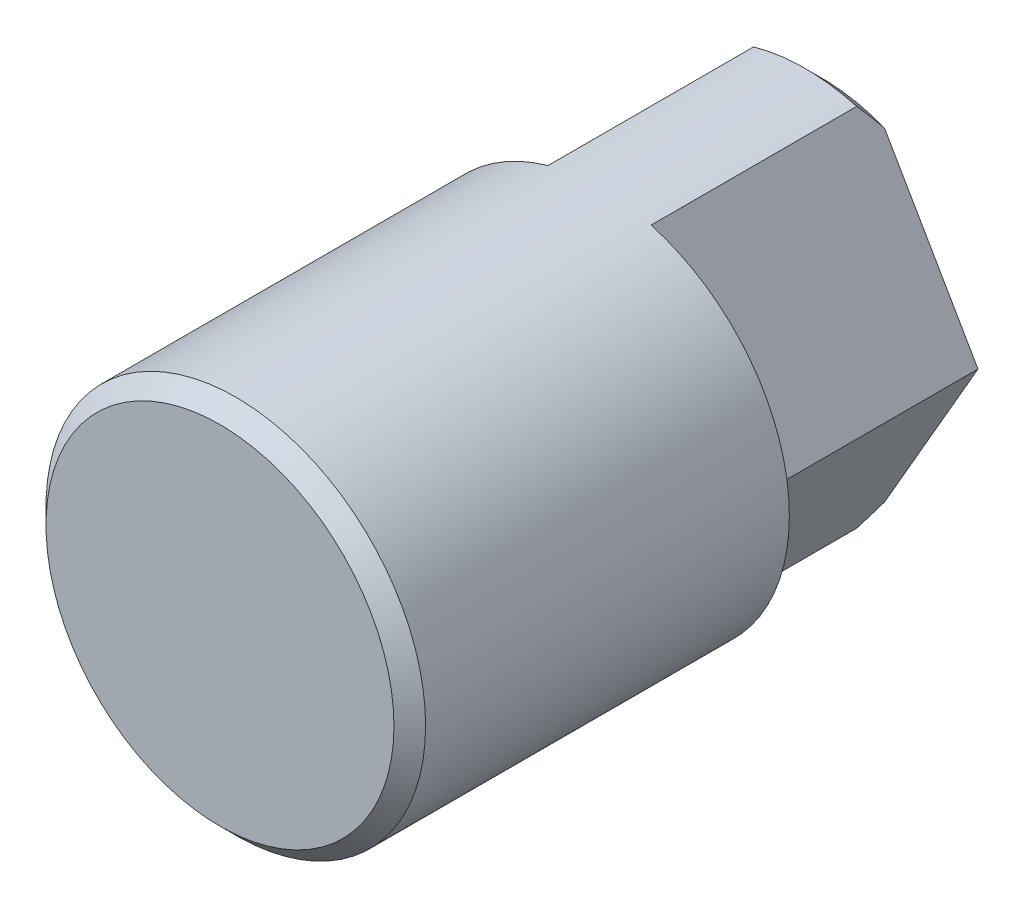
ISO-10303-21;
HEADER;
FILE_DESCRIPTION(('STEP AP214'),'2;1');
FILE_NAME('part.step','',(''),(''),'','','');
FILE_SCHEMA(('AUTOMOTIVE_DESIGN { 1 0 10303 214 1 1 1 1 }'));
ENDSEC;
DATA;
#1=APPLICATION_CONTEXT('core data for automotive mechanical design processes');
#2=APPLICATION_PROTOCOL_DEFINITION('international standard','automotive_design',2000,#1);
#3=PRODUCT_CONTEXT('',#1,'mechanical');
#4=PRODUCT('Part','Part','',(#3));
#5=PRODUCT_RELATED_PRODUCT_CATEGORY('part','',(#4));
#6=PRODUCT_DEFINITION_FORMATION('','',#4);
#7=PRODUCT_DEFINITION_CONTEXT('part definition',#1,'design');
#8=PRODUCT_DEFINITION('design','',#6,#7);
#9=PRODUCT_DEFINITION_SHAPE('','',#8);
#10=(LENGTH_UNIT() NAMED_UNIT(*) SI_UNIT(.MILLI.,.METRE.));
#11=(NAMED_UNIT(*) PLANE_ANGLE_UNIT() SI_UNIT($,.RADIAN.));
#12=(NAMED_UNIT(*) SI_UNIT($,.STERADIAN.) SOLID_ANGLE_UNIT());
#13=UNCERTAINTY_MEASURE_WITH_UNIT(LENGTH_MEASURE(1.E-05),#10,'distance_accuracy_value','');
#14=(GEOMETRIC_REPRESENTATION_CONTEXT(3) GLOBAL_UNCERTAINTY_ASSIGNED_CONTEXT((#13)) GLOBAL_UNIT_ASSIGNED_CONTEXT((#10,
#11,#12)) REPRESENTATION_CONTEXT('',''));
#15=CARTESIAN_POINT('',(0.,0.,0.));
#16=DIRECTION('',(0.,0.,1.));
#17=DIRECTION('',(1.,0.,0.));
#18=AXIS2_PLACEMENT_3D('',#15,#16,#17);
#19=CARTESIAN_POINT('',(0.,0.,0.));
#20=DIRECTION('',(0.,0.,1.));
#21=DIRECTION('',(1.,0.,0.));
#22=AXIS2_PLACEMENT_3D('',#19,#20,#21);
#23=CYLINDRICAL_SURFACE('',#22,6.);
#24=CARTESIAN_POINT('',(0.,0.,18.5));
#25=DIRECTION('',(0.,0.,1.));
#26=DIRECTION('',(1.,0.,0.));
#27=AXIS2_PLACEMENT_3D('',#24,#25,#26);
#28=CIRCLE('',#27,6.);
#29=CARTESIAN_POINT('',(6.,0.,18.5));
#30=VERTEX_POINT('',#29);
#31=EDGE_CURVE('E9',#30,#30,#28,.F.);
#32=ORIENTED_EDGE('',*,*,#31,.T.);
#33=EDGE_LOOP('',(#32));
#34=FACE_BOUND('',#33,.T.);
#35=CARTESIAN_POINT('',(0.,0.,7.));
#36=DIRECTION('',(0.,0.,-1.));
#37=DIRECTION('',(-1.,0.,0.));
#38=AXIS2_PLACEMENT_3D('',#35,#36,#37);
#39=CIRCLE('',#38,6.);
#40=CARTESIAN_POINT('',(1.63,5.77434844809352,7.));
#41=VERTEX_POINT('',#40);
#42=CARTESIAN_POINT('',(1.63,-5.77434844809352,7.));
#43=VERTEX_POINT('',#42);
#44=EDGE_CURVE('E175',#41,#43,#39,.T.);
#45=ORIENTED_EDGE('',*,*,#44,.F.);
#46=DIRECTION('',(0.,0.,-1.));
#47=VECTOR('',#46,1.);
#48=CARTESIAN_POINT('',(1.63,5.77434844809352,7.));
#49=LINE('',#48,#47);
#50=CARTESIAN_POINT('',(1.63,5.77434844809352,0.5));
#51=VERTEX_POINT('',#50);
#52=EDGE_CURVE('E86',#41,#51,#49,.T.);
#53=ORIENTED_EDGE('',*,*,#52,.T.);
#54=CARTESIAN_POINT('',(0.,0.,0.5));
#55=DIRECTION('',(0.,0.,-1.));
#56=DIRECTION('',(-1.,0.,0.));
#57=AXIS2_PLACEMENT_3D('',#54,#55,#56);
#58=CIRCLE('',#57,6.);
#59=CARTESIAN_POINT('',(-1.63,5.77434844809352,0.5));
#60=VERTEX_POINT('',#59);
#61=EDGE_CURVE('E120',#51,#60,#58,.F.);
#62=ORIENTED_EDGE('',*,*,#61,.T.);
#63=DIRECTION('',(0.,0.,-1.));
#64=VECTOR('',#63,1.);
#65=CARTESIAN_POINT('',(-1.63,5.77434844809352,7.));
#66=LINE('',#65,#64);
#67=CARTESIAN_POINT('',(-1.63,5.77434844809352,7.));
#68=VERTEX_POINT('',#67);
#69=EDGE_CURVE('E36',#68,#60,#66,.T.);
#70=ORIENTED_EDGE('',*,*,#69,.F.);
#71=CARTESIAN_POINT('',(-1.63,-5.77434844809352,7.));
#72=VERTEX_POINT('',#71);
#73=EDGE_CURVE('E170',#72,#68,#39,.T.);
#74=ORIENTED_EDGE('',*,*,#73,.F.);
#75=DIRECTION('',(0.,0.,-1.));
#76=VECTOR('',#75,1.);
#77=CARTESIAN_POINT('',(-1.63,-5.77434844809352,7.));
#78=LINE('',#77,#76);
#79=CARTESIAN_POINT('',(-1.63,-5.77434844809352,0.5));
#80=VERTEX_POINT('',#79);
#81=EDGE_CURVE('E117',#72,#80,#78,.T.);
#82=ORIENTED_EDGE('',*,*,#81,.T.);
#83=CARTESIAN_POINT('',(1.63,-5.77434844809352,0.5));
#84=VERTEX_POINT('',#83);
#85=EDGE_CURVE('E126',#80,#84,#58,.F.);
#86=ORIENTED_EDGE('',*,*,#85,.T.);
#87=DIRECTION('',(0.,0.,-1.));
#88=VECTOR('',#87,1.);
#89=CARTESIAN_POINT('',(1.63,-5.77434844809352,7.));
#90=LINE('',#89,#88);
#91=EDGE_CURVE('E85',#43,#84,#90,.T.);
#92=ORIENTED_EDGE('',*,*,#91,.F.);
#93=EDGE_LOOP('',(#45,#53,#62,#70,#74,#82,#86,#92));
#94=FACE_BOUND('',#93,.T.);
#95=ADVANCED_FACE('F14',(#34,#94),#23,.T.);
#96=CARTESIAN_POINT('',(0.,0.,0.));
#97=DIRECTION('',(0.,0.,-1.));
#98=DIRECTION('',(-1.,0.,0.));
#99=AXIS2_PLACEMENT_3D('',#96,#97,#98);
#100=PLANE('',#99);
#101=DIRECTION('',(0.5,-0.866025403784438,0.));
#102=VECTOR('',#101,1.);
#103=CARTESIAN_POINT('',(1.63,5.77434844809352,0.));
#104=LINE('',#103,#102);
#105=CARTESIAN_POINT('',(2.00746859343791,5.1205536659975,0.));
#106=VERTEX_POINT('',#105);
#107=CARTESIAN_POINT('',(4.9638216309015,0.,0.));
#108=VERTEX_POINT('',#107);
#109=EDGE_CURVE('E28',#106,#108,#104,.T.);
#110=ORIENTED_EDGE('',*,*,#109,.T.);
#111=DIRECTION('',(-0.5,-0.866025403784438,0.));
#112=VECTOR('',#111,1.);
#113=CARTESIAN_POINT('',(1.63,-5.77434844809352,0.));
#114=LINE('',#113,#112);
#115=CARTESIAN_POINT('',(2.00746859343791,-5.1205536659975,0.));
#116=VERTEX_POINT('',#115);
#117=EDGE_CURVE('E89',#108,#116,#114,.T.);
#118=ORIENTED_EDGE('',*,*,#117,.T.);
#119=CARTESIAN_POINT('',(0.,0.,0.));
#120=DIRECTION('',(0.,0.,-1.));
#121=DIRECTION('',(-1.,0.,0.));
#122=AXIS2_PLACEMENT_3D('',#119,#120,#121);
#123=CIRCLE('',#122,5.5);
#124=CARTESIAN_POINT('',(-2.00746859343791,-5.1205536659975,0.));
#125=VERTEX_POINT('',#124);
#126=EDGE_CURVE('E129',#116,#125,#123,.T.);
#127=ORIENTED_EDGE('',*,*,#126,.T.);
#128=DIRECTION('',(-0.5,0.866025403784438,0.));
#129=VECTOR('',#128,1.);
#130=CARTESIAN_POINT('',(-1.63,-5.77434844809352,0.));
#131=LINE('',#130,#129);
#132=CARTESIAN_POINT('',(-4.9638216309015,0.,0.));
#133=VERTEX_POINT('',#132);
#134=EDGE_CURVE('E105',#125,#133,#131,.T.);
#135=ORIENTED_EDGE('',*,*,#134,.T.);
#136=DIRECTION('',(0.5,0.866025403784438,0.));
#137=VECTOR('',#136,1.);
#138=CARTESIAN_POINT('',(-1.63,5.77434844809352,0.));
#139=LINE('',#138,#137);
#140=CARTESIAN_POINT('',(-2.00746859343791,5.1205536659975,0.));
#141=VERTEX_POINT('',#140);
#142=EDGE_CURVE('E103',#133,#141,#139,.T.);
#143=ORIENTED_EDGE('',*,*,#142,.T.);
#144=EDGE_CURVE('E102',#141,#106,#123,.T.);
#145=ORIENTED_EDGE('',*,*,#144,.T.);
#146=EDGE_LOOP('',(#110,#118,#127,#135,#143,#145));
#147=FACE_BOUND('',#146,.T.);
#148=ADVANCED_FACE('F99',(#147),#100,.T.);
#149=CARTESIAN_POINT('',(0.,0.,0.));
#150=DIRECTION('',(0.,0.,1.));
#151=DIRECTION('',(1.,0.,0.));
#152=AXIS2_PLACEMENT_3D('',#149,#150,#151);
#153=CONICAL_SURFACE('',#152,5.5,0.785398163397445);
#154=ORIENTED_EDGE('',*,*,#85,.F.);
#155=CARTESIAN_POINT('',(-1.62988452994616,-5.77454844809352,0.500161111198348));
#156=CARTESIAN_POINT('',(-1.66085599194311,-5.72090430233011,0.456948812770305));
#157=CARTESIAN_POINT('',(-1.69194256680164,-5.66706077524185,0.414064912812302));
#158=CARTESIAN_POINT('',(-1.7543589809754,-5.55895237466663,0.329033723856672));
#159=CARTESIAN_POINT('',(-1.7856887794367,-5.50468757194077,0.286886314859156));
#160=CARTESIAN_POINT('',(-1.84861554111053,-5.39569522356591,0.203392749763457));
#161=CARTESIAN_POINT('',(-1.88021251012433,-5.34096766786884,0.162046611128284));
#162=CARTESIAN_POINT('',(-1.94369815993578,-5.23100729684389,0.0802372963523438));
#163=CARTESIAN_POINT('',(-1.97558688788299,-5.17577439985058,0.0397742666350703));
#164=CARTESIAN_POINT('',(-2.00762891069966,-5.12027598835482,-0.000199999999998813));
#165=B_SPLINE_CURVE_WITH_KNOTS('',3,(#155,#156,#157,#158,#159,#160,#161,#162,#163,#164),
.UNSPECIFIED.,.F.,.F.,(4,2,2,2,4),(0.,0.226579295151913,0.453121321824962,0.679668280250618,
0.906252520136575),.UNSPECIFIED.);
#166=EDGE_CURVE('E163',#80,#125,#165,.T.);
#167=ORIENTED_EDGE('',*,*,#166,.T.);
#168=ORIENTED_EDGE('',*,*,#126,.F.);
#169=CARTESIAN_POINT('',(2.00762891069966,-5.12027598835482,-0.000199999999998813));
#170=CARTESIAN_POINT('',(1.97558688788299,-5.17577439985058,0.0397742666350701));
#171=CARTESIAN_POINT('',(1.94369815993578,-5.23100729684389,0.0802372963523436));
#172=CARTESIAN_POINT('',(1.88021251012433,-5.34096766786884,0.162046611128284));
#173=CARTESIAN_POINT('',(1.84861554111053,-5.39569522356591,0.203392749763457));
#174=CARTESIAN_POINT('',(1.7856887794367,-5.50468757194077,0.286886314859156));
#175=CARTESIAN_POINT('',(1.7543589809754,-5.55895237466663,0.329033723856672));
#176=CARTESIAN_POINT('',(1.69194256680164,-5.66706077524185,0.414064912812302));
#177=CARTESIAN_POINT('',(1.66085599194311,-5.72090430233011,0.456948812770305));
#178=CARTESIAN_POINT('',(1.62988452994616,-5.77454844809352,0.500161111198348));
#179=B_SPLINE_CURVE_WITH_KNOTS('',3,(#169,#170,#171,#172,#173,#174,#175,#176,#177,#178),
.UNSPECIFIED.,.F.,.F.,(4,2,2,2,4),(0.,0.226584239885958,0.453131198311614,0.679673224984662,
0.906252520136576),.UNSPECIFIED.);
#180=EDGE_CURVE('E92',#116,#84,#179,.T.);
#181=ORIENTED_EDGE('',*,*,#180,.T.);
#182=EDGE_LOOP('',(#154,#167,#168,#181));
#183=FACE_BOUND('',#182,.T.);
#184=ADVANCED_FACE('F146',(#183),#153,.T.);
#185=ORIENTED_EDGE('',*,*,#61,.F.);
#186=CARTESIAN_POINT('',(1.62988452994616,5.77454844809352,0.500161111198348));
#187=CARTESIAN_POINT('',(1.66085599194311,5.72090430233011,0.456948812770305));
#188=CARTESIAN_POINT('',(1.69194256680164,5.66706077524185,0.414064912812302));
#189=CARTESIAN_POINT('',(1.7543589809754,5.55895237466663,0.329033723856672));
#190=CARTESIAN_POINT('',(1.7856887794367,5.50468757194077,0.286886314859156));
#191=CARTESIAN_POINT('',(1.84861554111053,5.39569522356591,0.203392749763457));
#192=CARTESIAN_POINT('',(1.88021251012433,5.34096766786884,0.162046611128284));
#193=CARTESIAN_POINT('',(1.94369815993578,5.23100729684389,0.0802372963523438));
#194=CARTESIAN_POINT('',(1.97558688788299,5.17577439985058,0.0397742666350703));
#195=CARTESIAN_POINT('',(2.00762891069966,5.12027598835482,-0.000199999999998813));
#196=B_SPLINE_CURVE_WITH_KNOTS('',3,(#186,#187,#188,#189,#190,#191,#192,#193,#194,#195),
.UNSPECIFIED.,.F.,.F.,(4,2,2,2,4),(0.,0.226579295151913,0.453121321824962,0.679668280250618,
0.906252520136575),.UNSPECIFIED.);
#197=EDGE_CURVE('E139',#51,#106,#196,.T.);
#198=ORIENTED_EDGE('',*,*,#197,.T.);
#199=ORIENTED_EDGE('',*,*,#144,.F.);
#200=CARTESIAN_POINT('',(-2.00762891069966,5.12027598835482,-0.000199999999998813));
#201=CARTESIAN_POINT('',(-1.97558688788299,5.17577439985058,0.0397742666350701));
#202=CARTESIAN_POINT('',(-1.94369815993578,5.23100729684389,0.0802372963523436));
#203=CARTESIAN_POINT('',(-1.88021251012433,5.34096766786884,0.162046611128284));
#204=CARTESIAN_POINT('',(-1.84861554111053,5.39569522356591,0.203392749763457));
#205=CARTESIAN_POINT('',(-1.7856887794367,5.50468757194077,0.286886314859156));
#206=CARTESIAN_POINT('',(-1.7543589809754,5.55895237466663,0.329033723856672));
#207=CARTESIAN_POINT('',(-1.69194256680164,5.66706077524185,0.414064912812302));
#208=CARTESIAN_POINT('',(-1.66085599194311,5.72090430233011,0.456948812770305));
#209=CARTESIAN_POINT('',(-1.62988452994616,5.77454844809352,0.500161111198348));
#210=B_SPLINE_CURVE_WITH_KNOTS('',3,(#200,#201,#202,#203,#204,#205,#206,#207,#208,#209),
.UNSPECIFIED.,.F.,.F.,(4,2,2,2,4),(0.,0.226584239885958,0.453131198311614,0.679673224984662,
0.906252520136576),.UNSPECIFIED.);
#211=EDGE_CURVE('E131',#141,#60,#210,.T.);
#212=ORIENTED_EDGE('',*,*,#211,.T.);
#213=EDGE_LOOP('',(#185,#198,#199,#212));
#214=FACE_BOUND('',#213,.T.);
#215=ADVANCED_FACE('F154',(#214),#153,.T.);
#216=CARTESIAN_POINT('',(-1.63,5.77434844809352,7.));
#217=DIRECTION('',(-0.866025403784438,0.5,0.));
#218=DIRECTION('',(0.5,0.866025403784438,0.));
#219=AXIS2_PLACEMENT_3D('',#216,#217,#218);
#220=PLANE('',#219);
#221=ORIENTED_EDGE('',*,*,#142,.F.);
#222=DIRECTION('',(0.,0.,-1.));
#223=VECTOR('',#222,1.);
#224=CARTESIAN_POINT('',(-4.9638216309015,0.,7.));
#225=LINE('',#224,#223);
#226=CARTESIAN_POINT('',(-4.9638216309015,0.,7.));
#227=VERTEX_POINT('',#226);
#228=EDGE_CURVE('E116',#227,#133,#225,.T.);
#229=ORIENTED_EDGE('',*,*,#228,.F.);
#230=DIRECTION('',(0.5,0.866025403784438,0.));
#231=VECTOR('',#230,1.);
#232=CARTESIAN_POINT('',(-1.63,5.77434844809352,7.));
#233=LINE('',#232,#231);
#234=EDGE_CURVE('E111',#227,#68,#233,.T.);
#235=ORIENTED_EDGE('',*,*,#234,.T.);
#236=ORIENTED_EDGE('',*,*,#69,.T.);
#237=ORIENTED_EDGE('',*,*,#211,.F.);
#238=EDGE_LOOP('',(#221,#229,#235,#236,#237));
#239=FACE_BOUND('',#238,.T.);
#240=ADVANCED_FACE('F149',(#239),#220,.T.);
#241=CARTESIAN_POINT('',(-1.63,-5.77434844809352,7.));
#242=DIRECTION('',(-0.866025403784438,-0.5,0.));
#243=DIRECTION('',(-0.5,0.866025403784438,0.));
#244=AXIS2_PLACEMENT_3D('',#241,#242,#243);
#245=PLANE('',#244);
#246=ORIENTED_EDGE('',*,*,#81,.F.);
#247=DIRECTION('',(-0.5,0.866025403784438,0.));
#248=VECTOR('',#247,1.);
#249=CARTESIAN_POINT('',(-1.63,-5.77434844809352,7.));
#250=LINE('',#249,#248);
#251=EDGE_CURVE('E96',#72,#227,#250,.T.);
#252=ORIENTED_EDGE('',*,*,#251,.T.);
#253=ORIENTED_EDGE('',*,*,#228,.T.);
#254=ORIENTED_EDGE('',*,*,#134,.F.);
#255=ORIENTED_EDGE('',*,*,#166,.F.);
#256=EDGE_LOOP('',(#246,#252,#253,#254,#255));
#257=FACE_BOUND('',#256,.T.);
#258=ADVANCED_FACE('F153',(#257),#245,.T.);
#259=CARTESIAN_POINT('',(0.,0.,7.));
#260=DIRECTION('',(0.,0.,-1.));
#261=DIRECTION('',(-1.,0.,0.));
#262=AXIS2_PLACEMENT_3D('',#259,#260,#261);
#263=PLANE('',#262);
#264=ORIENTED_EDGE('',*,*,#73,.T.);
#265=ORIENTED_EDGE('',*,*,#234,.F.);
#266=ORIENTED_EDGE('',*,*,#251,.F.);
#267=EDGE_LOOP('',(#264,#265,#266));
#268=FACE_BOUND('',#267,.T.);
#269=ADVANCED_FACE('F159',(#268),#263,.T.);
#270=ORIENTED_EDGE('',*,*,#44,.T.);
#271=DIRECTION('',(-0.5,-0.866025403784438,0.));
#272=VECTOR('',#271,1.);
#273=CARTESIAN_POINT('',(1.63,-5.77434844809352,7.));
#274=LINE('',#273,#272);
#275=CARTESIAN_POINT('',(4.9638216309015,0.,7.));
#276=VERTEX_POINT('',#275);
#277=EDGE_CURVE('E114',#276,#43,#274,.T.);
#278=ORIENTED_EDGE('',*,*,#277,.F.);
#279=DIRECTION('',(0.5,-0.866025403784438,0.));
#280=VECTOR('',#279,1.);
#281=CARTESIAN_POINT('',(1.63,5.77434844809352,7.));
#282=LINE('',#281,#280);
#283=EDGE_CURVE('E81',#41,#276,#282,.T.);
#284=ORIENTED_EDGE('',*,*,#283,.F.);
#285=EDGE_LOOP('',(#270,#278,#284));
#286=FACE_BOUND('',#285,.T.);
#287=ADVANCED_FACE('F161',(#286),#263,.T.);
#288=CARTESIAN_POINT('',(1.63,-5.77434844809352,7.));
#289=DIRECTION('',(0.866025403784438,-0.5,0.));
#290=DIRECTION('',(-0.5,-0.866025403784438,0.));
#291=AXIS2_PLACEMENT_3D('',#288,#289,#290);
#292=PLANE('',#291);
#293=ORIENTED_EDGE('',*,*,#117,.F.);
#294=DIRECTION('',(0.,0.,-1.));
#295=VECTOR('',#294,1.);
#296=CARTESIAN_POINT('',(4.9638216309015,0.,7.));
#297=LINE('',#296,#295);
#298=EDGE_CURVE('E77',#276,#108,#297,.T.);
#299=ORIENTED_EDGE('',*,*,#298,.F.);
#300=ORIENTED_EDGE('',*,*,#277,.T.);
#301=ORIENTED_EDGE('',*,*,#91,.T.);
#302=ORIENTED_EDGE('',*,*,#180,.F.);
#303=EDGE_LOOP('',(#293,#299,#300,#301,#302));
#304=FACE_BOUND('',#303,.T.);
#305=ADVANCED_FACE('F90',(#304),#292,.T.);
#306=CARTESIAN_POINT('',(1.63,5.77434844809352,7.));
#307=DIRECTION('',(0.866025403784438,0.5,0.));
#308=DIRECTION('',(0.5,-0.866025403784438,0.));
#309=AXIS2_PLACEMENT_3D('',#306,#307,#308);
#310=PLANE('',#309);
#311=ORIENTED_EDGE('',*,*,#52,.F.);
#312=ORIENTED_EDGE('',*,*,#283,.T.);
#313=ORIENTED_EDGE('',*,*,#298,.T.);
#314=ORIENTED_EDGE('',*,*,#109,.F.);
#315=ORIENTED_EDGE('',*,*,#197,.F.);
#316=EDGE_LOOP('',(#311,#312,#313,#314,#315));
#317=FACE_BOUND('',#316,.T.);
#318=ADVANCED_FACE('F79',(#317),#310,.T.);
#319=CARTESIAN_POINT('',(0.,0.,19.));
#320=DIRECTION('',(0.,0.,1.));
#321=DIRECTION('',(1.,0.,0.));
#322=AXIS2_PLACEMENT_3D('',#319,#320,#321);
#323=PLANE('',#322);
#324=CARTESIAN_POINT('',(0.,0.,19.));
#325=DIRECTION('',(0.,0.,1.));
#326=DIRECTION('',(1.,0.,0.));
#327=AXIS2_PLACEMENT_3D('',#324,#325,#326);
#328=CIRCLE('',#327,5.5);
#329=CARTESIAN_POINT('',(5.5,0.,19.));
#330=VERTEX_POINT('',#329);
#331=EDGE_CURVE('E21',#330,#330,#328,.T.);
#332=ORIENTED_EDGE('',*,*,#331,.T.);
#333=EDGE_LOOP('',(#332));
#334=FACE_BOUND('',#333,.T.);
#335=ADVANCED_FACE('F211',(#334),#323,.T.);
#336=CARTESIAN_POINT('',(0.,0.,19.));
#337=DIRECTION('',(0.,0.,-1.));
#338=DIRECTION('',(-1.,0.,0.));
#339=AXIS2_PLACEMENT_3D('',#336,#337,#338);
#340=CONICAL_SURFACE('',#339,5.5,0.785398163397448);
#341=ORIENTED_EDGE('',*,*,#31,.F.);
#342=EDGE_LOOP('',(#341));
#343=FACE_BOUND('',#342,.T.);
#344=ORIENTED_EDGE('',*,*,#331,.F.);
#345=EDGE_LOOP('',(#344));
#346=FACE_BOUND('',#345,.T.);
#347=ADVANCED_FACE('F208',(#343,#346),#340,.T.);
#348=CLOSED_SHELL('',(#95,#148,#184,#215,#240,#258,#269,#287,#305,#318,#335,#347));
#349=MANIFOLD_SOLID_BREP('B1',#348);
#350=ADVANCED_BREP_SHAPE_REPRESENTATION('',(#18,#349),#14);
#351=SHAPE_DEFINITION_REPRESENTATION(#9,#350);
ENDSEC;
END-ISO-10303-21;
